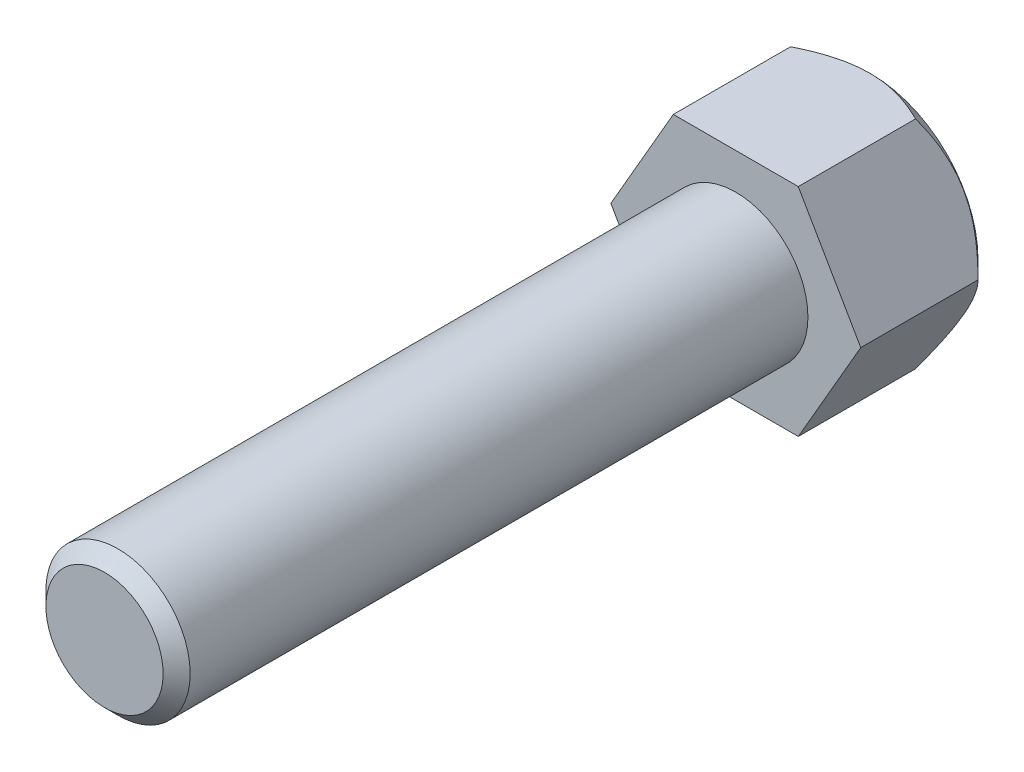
ISO-10303-21;
HEADER;
FILE_DESCRIPTION(('STEP AP214'),'2;1');
FILE_NAME('part.step','',(''),(''),'','','');
FILE_SCHEMA(('AUTOMOTIVE_DESIGN { 1 0 10303 214 1 1 1 1 }'));
ENDSEC;
DATA;
#1=APPLICATION_CONTEXT('core data for automotive mechanical design processes');
#2=APPLICATION_PROTOCOL_DEFINITION('international standard','automotive_design',2000,#1);
#3=PRODUCT_CONTEXT('',#1,'mechanical');
#4=PRODUCT('Part','Part','',(#3));
#5=PRODUCT_RELATED_PRODUCT_CATEGORY('part','',(#4));
#6=PRODUCT_DEFINITION_FORMATION('','',#4);
#7=PRODUCT_DEFINITION_CONTEXT('part definition',#1,'design');
#8=PRODUCT_DEFINITION('design','',#6,#7);
#9=PRODUCT_DEFINITION_SHAPE('','',#8);
#10=(LENGTH_UNIT() NAMED_UNIT(*) SI_UNIT(.MILLI.,.METRE.));
#11=(NAMED_UNIT(*) PLANE_ANGLE_UNIT() SI_UNIT($,.RADIAN.));
#12=(NAMED_UNIT(*) SI_UNIT($,.STERADIAN.) SOLID_ANGLE_UNIT());
#13=UNCERTAINTY_MEASURE_WITH_UNIT(LENGTH_MEASURE(1.E-05),#10,'distance_accuracy_value','');
#14=(GEOMETRIC_REPRESENTATION_CONTEXT(3) GLOBAL_UNCERTAINTY_ASSIGNED_CONTEXT((#13)) GLOBAL_UNIT_ASSIGNED_CONTEXT((#10,
#11,#12)) REPRESENTATION_CONTEXT('',''));
#15=CARTESIAN_POINT('',(0.,0.,0.));
#16=DIRECTION('',(0.,0.,1.));
#17=DIRECTION('',(1.,0.,0.));
#18=AXIS2_PLACEMENT_3D('',#15,#16,#17);
#19=CARTESIAN_POINT('',(6.92820323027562,-11.9999999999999,15.));
#20=DIRECTION('',(-0.866025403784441,0.499999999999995,0.));
#21=DIRECTION('',(-0.499999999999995,-0.866025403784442,0.));
#22=AXIS2_PLACEMENT_3D('',#19,#20,#21);
#23=PLANE('',#22);
#24=CARTESIAN_POINT('',(13.8565219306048,0.0002,2.0001154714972));
#25=CARTESIAN_POINT('',(13.7374109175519,-0.206106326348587,1.88102204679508));
#26=CARTESIAN_POINT('',(13.6173670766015,-0.414028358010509,1.76556272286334));
#27=CARTESIAN_POINT('',(13.3752685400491,-0.833355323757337,1.54306664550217));
#28=CARTESIAN_POINT('',(13.2532127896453,-1.04476208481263,1.43603449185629));
#29=CARTESIAN_POINT('',(13.006369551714,-1.47230711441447,1.23109384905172));
#30=CARTESIAN_POINT('',(12.8815704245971,-1.6884655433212,1.13324110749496));
#31=CARTESIAN_POINT('',(12.6299224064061,-2.12433269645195,0.948784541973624));
#32=CARTESIAN_POINT('',(12.5030738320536,-2.3440408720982,0.86217899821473));
#33=CARTESIAN_POINT('',(12.2493664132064,-2.78347501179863,0.702957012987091));
#34=CARTESIAN_POINT('',(12.1225387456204,-3.0031469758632,0.630143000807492));
#35=CARTESIAN_POINT('',(11.8671055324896,-3.4455702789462,0.498319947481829));
#36=CARTESIAN_POINT('',(11.7385001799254,-3.66832128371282,0.439309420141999));
#37=CARTESIAN_POINT('',(11.480061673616,-4.11594990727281,0.336578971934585));
#38=CARTESIAN_POINT('',(11.3502319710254,-4.34082154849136,0.292824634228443));
#39=CARTESIAN_POINT('',(11.0894826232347,-4.79245266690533,0.221567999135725));
#40=CARTESIAN_POINT('',(10.9585631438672,-5.01921185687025,0.194063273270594));
#41=CARTESIAN_POINT('',(10.6395223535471,-5.57180671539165,0.147945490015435));
#42=CARTESIAN_POINT('',(10.4510562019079,-5.89823966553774,0.138267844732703));
#43=CARTESIAN_POINT('',(10.0744647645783,-6.55051516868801,0.154512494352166));
#44=CARTESIAN_POINT('',(9.88633962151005,-6.87635747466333,0.180447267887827));
#45=CARTESIAN_POINT('',(9.5118627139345,-7.52497050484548,0.266385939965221));
#46=CARTESIAN_POINT('',(9.32551316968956,-7.84773738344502,0.326427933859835));
#47=CARTESIAN_POINT('',(8.95601707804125,-8.48772338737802,0.477317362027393));
#48=CARTESIAN_POINT('',(8.77287028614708,-8.80494293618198,0.568162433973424));
#49=CARTESIAN_POINT('',(8.44776278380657,-9.36804564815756,0.755051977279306));
#50=CARTESIAN_POINT('',(8.30508197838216,-9.6151760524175,0.846179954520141));
#51=CARTESIAN_POINT('',(8.02228146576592,-10.1050009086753,1.04311985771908));
#52=CARTESIAN_POINT('',(7.88216183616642,-10.3476952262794,1.14893222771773));
#53=CARTESIAN_POINT('',(7.60492501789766,-10.8278834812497,1.37286925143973));
#54=CARTESIAN_POINT('',(7.46779994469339,-11.065391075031,1.49095518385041));
#55=CARTESIAN_POINT('',(7.19608877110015,-11.5360086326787,1.73788924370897));
#56=CARTESIAN_POINT('',(7.06150117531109,-11.7691211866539,1.86673077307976));
#57=CARTESIAN_POINT('',(6.92808776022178,-12.0001999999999,2.0001154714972));
#58=B_SPLINE_CURVE_WITH_KNOTS('',3,(#24,#25,#26,#27,#28,#29,#30,#31,#32,#33,#34,#35,#36,#37,#38,
#39,#40,#41,#42,#43,#44,#45,#46,#47,#48,#49,#50,#51,#52,#53,#54,#55,#56,#57),.UNSPECIFIED.,.F.,
.F.,(4,2,2,2,2,2,2,2,2,2,2,2,2,2,2,2,4),(0.,0.79903119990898,1.59849555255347,2.40253734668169,
3.20645605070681,3.99780391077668,4.7890665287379,5.57853238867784,6.36788023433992,
7.49728680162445,8.62708921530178,9.75815602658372,10.8891361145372,11.7873913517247,
12.6856737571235,13.5812036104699,14.4761880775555),.UNSPECIFIED.);
#59=CARTESIAN_POINT('',(13.856406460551,0.,2.));
#60=VERTEX_POINT('',#59);
#61=CARTESIAN_POINT('',(6.92820323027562,-11.9999999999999,2.));
#62=VERTEX_POINT('',#61);
#63=EDGE_CURVE('E48',#60,#62,#58,.T.);
#64=ORIENTED_EDGE('',*,*,#63,.F.);
#65=DIRECTION('',(0.,0.,-1.));
#66=VECTOR('',#65,1.);
#67=CARTESIAN_POINT('',(13.856406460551,0.,15.));
#68=LINE('',#67,#66);
#69=CARTESIAN_POINT('',(13.856406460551,0.,15.));
#70=VERTEX_POINT('',#69);
#71=EDGE_CURVE('E119',#70,#60,#68,.T.);
#72=ORIENTED_EDGE('',*,*,#71,.F.);
#73=DIRECTION('',(0.499999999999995,0.866025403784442,0.));
#74=VECTOR('',#73,1.);
#75=CARTESIAN_POINT('',(6.92820323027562,-11.9999999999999,15.));
#76=LINE('',#75,#74);
#77=CARTESIAN_POINT('',(6.92820323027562,-11.9999999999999,15.));
#78=VERTEX_POINT('',#77);
#79=EDGE_CURVE('E212',#78,#70,#76,.T.);
#80=ORIENTED_EDGE('',*,*,#79,.F.);
#81=DIRECTION('',(0.,0.,-1.));
#82=VECTOR('',#81,1.);
#83=CARTESIAN_POINT('',(6.92820323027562,-11.9999999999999,15.));
#84=LINE('',#83,#82);
#85=EDGE_CURVE('E113',#78,#62,#84,.T.);
#86=ORIENTED_EDGE('',*,*,#85,.T.);
#87=EDGE_LOOP('',(#64,#72,#80,#86));
#88=FACE_BOUND('',#87,.T.);
#89=ADVANCED_FACE('F33',(#88),#23,.F.);
#90=CARTESIAN_POINT('',(13.856406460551,0.,15.));
#91=DIRECTION('',(-0.866025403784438,-0.500000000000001,0.));
#92=DIRECTION('',(0.500000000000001,-0.866025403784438,0.));
#93=AXIS2_PLACEMENT_3D('',#90,#91,#92);
#94=PLANE('',#93);
#95=CARTESIAN_POINT('',(6.92808776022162,12.0002,2.0001154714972));
#96=CARTESIAN_POINT('',(7.0471987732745,11.7938936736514,1.88102204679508));
#97=CARTESIAN_POINT('',(7.16724261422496,11.5859716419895,1.76556272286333));
#98=CARTESIAN_POINT('',(7.40934115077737,11.1666446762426,1.54306664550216));
#99=CARTESIAN_POINT('',(7.53139690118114,10.9552379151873,1.43603449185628));
#100=CARTESIAN_POINT('',(7.77824013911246,10.5276928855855,1.2310938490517));
#101=CARTESIAN_POINT('',(7.90303926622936,10.3115344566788,1.13324110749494));
#102=CARTESIAN_POINT('',(8.15468728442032,9.87566730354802,0.9487845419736));
#103=CARTESIAN_POINT('',(8.28153585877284,9.65595912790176,0.862178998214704));
#104=CARTESIAN_POINT('',(8.53524327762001,9.21652498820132,0.702957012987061));
#105=CARTESIAN_POINT('',(8.6620709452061,8.99685302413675,0.630143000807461));
#106=CARTESIAN_POINT('',(8.91750415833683,8.55442972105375,0.498319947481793));
#107=CARTESIAN_POINT('',(9.0461095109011,8.33167871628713,0.439309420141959));
#108=CARTESIAN_POINT('',(9.30454801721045,7.88405009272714,0.336578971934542));
#109=CARTESIAN_POINT('',(9.43437771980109,7.65917845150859,0.292824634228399));
#110=CARTESIAN_POINT('',(9.69512706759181,7.20754733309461,0.221567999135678));
#111=CARTESIAN_POINT('',(9.82604654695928,6.98078814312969,0.194063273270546));
#112=CARTESIAN_POINT('',(10.1450873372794,6.42819328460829,0.147945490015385));
#113=CARTESIAN_POINT('',(10.3335534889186,6.10176033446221,0.138267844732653));
#114=CARTESIAN_POINT('',(10.7101449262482,5.44948483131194,0.154512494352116));
#115=CARTESIAN_POINT('',(10.8982700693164,5.12364252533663,0.180447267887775));
#116=CARTESIAN_POINT('',(11.272746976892,4.47502949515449,0.266385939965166));
#117=CARTESIAN_POINT('',(11.4590965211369,4.15226261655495,0.32642793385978));
#118=CARTESIAN_POINT('',(11.8285926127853,3.51227661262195,0.477317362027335));
#119=CARTESIAN_POINT('',(12.0117394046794,3.19505706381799,0.568162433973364));
#120=CARTESIAN_POINT('',(12.3368469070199,2.63195435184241,0.755051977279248));
#121=CARTESIAN_POINT('',(12.4795277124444,2.38482394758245,0.846179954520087));
#122=CARTESIAN_POINT('',(12.7623282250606,1.89499909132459,1.04311985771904));
#123=CARTESIAN_POINT('',(12.9024478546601,1.65230477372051,1.14893222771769));
#124=CARTESIAN_POINT('',(13.1796846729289,1.17211651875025,1.3728692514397));
#125=CARTESIAN_POINT('',(13.3168097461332,0.934608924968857,1.49095518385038));
#126=CARTESIAN_POINT('',(13.5885209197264,0.463991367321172,1.73788924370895));
#127=CARTESIAN_POINT('',(13.7231085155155,0.230878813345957,1.86673077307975));
#128=CARTESIAN_POINT('',(13.8565219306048,-0.000199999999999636,2.0001154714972));
#129=B_SPLINE_CURVE_WITH_KNOTS('',3,(#95,#96,#97,#98,#99,#100,#101,#102,#103,#104,#105,#106,
#107,#108,#109,#110,#111,#112,#113,#114,#115,#116,#117,#118,#119,#120,#121,#122,#123,#124,#125,
#126,#127,#128),.UNSPECIFIED.,.F.,.F.,(4,2,2,2,2,2,2,2,2,2,2,2,2,2,2,2,4),(0.,0.799031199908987,
1.59849555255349,2.40253734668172,3.20645605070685,3.99780391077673,4.78906652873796,
5.5785323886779,6.36788023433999,7.49728680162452,8.62708921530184,9.75815602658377,
10.8891361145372,11.7873913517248,12.6856737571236,13.58120361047,14.4761880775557),.UNSPECIFIED.);
#130=CARTESIAN_POINT('',(6.92820323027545,12.,2.));
#131=VERTEX_POINT('',#130);
#132=EDGE_CURVE('E157',#131,#60,#129,.T.);
#133=ORIENTED_EDGE('',*,*,#132,.F.);
#134=DIRECTION('',(0.,0.,-1.));
#135=VECTOR('',#134,1.);
#136=CARTESIAN_POINT('',(6.92820323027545,12.,15.));
#137=LINE('',#136,#135);
#138=CARTESIAN_POINT('',(6.92820323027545,12.,15.));
#139=VERTEX_POINT('',#138);
#140=EDGE_CURVE('E111',#139,#131,#137,.T.);
#141=ORIENTED_EDGE('',*,*,#140,.F.);
#142=DIRECTION('',(-0.500000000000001,0.866025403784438,0.));
#143=VECTOR('',#142,1.);
#144=CARTESIAN_POINT('',(13.856406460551,0.,15.));
#145=LINE('',#144,#143);
#146=EDGE_CURVE('E213',#70,#139,#145,.T.);
#147=ORIENTED_EDGE('',*,*,#146,.F.);
#148=ORIENTED_EDGE('',*,*,#71,.T.);
#149=EDGE_LOOP('',(#133,#141,#147,#148));
#150=FACE_BOUND('',#149,.T.);
#151=ADVANCED_FACE('F139',(#150),#94,.F.);
#152=CARTESIAN_POINT('',(6.92820323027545,12.,15.));
#153=DIRECTION('',(0.,-1.,0.));
#154=DIRECTION('',(1.,0.,0.));
#155=AXIS2_PLACEMENT_3D('',#152,#153,#154);
#156=PLANE('',#155);
#157=CARTESIAN_POINT('',(-14.4006888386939,11.9999999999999,6.88872194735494));
#158=CARTESIAN_POINT('',(-14.0525506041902,11.9999999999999,6.62132963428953));
#159=CARTESIAN_POINT('',(-13.702529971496,11.9999999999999,6.35634952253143));
#160=CARTESIAN_POINT('',(-12.9979568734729,11.9999999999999,5.83231381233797));
#161=CARTESIAN_POINT('',(-12.6434033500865,11.9999999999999,5.57325963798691));
#162=CARTESIAN_POINT('',(-11.9264058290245,11.9999999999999,5.06033222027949));
#163=CARTESIAN_POINT('',(-11.563922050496,11.9999999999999,4.80651440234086));
#164=CARTESIAN_POINT('',(-10.8329104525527,11.9999999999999,4.30776676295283));
#165=CARTESIAN_POINT('',(-10.4643830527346,11.9999999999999,4.06283632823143));
#166=CARTESIAN_POINT('',(-9.69689227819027,11.9999999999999,3.56883504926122));
#167=CARTESIAN_POINT('',(-9.29747155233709,11.9999999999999,3.32047118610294));
#168=CARTESIAN_POINT('',(-8.48925422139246,11.9999999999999,2.83923861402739));
#169=CARTESIAN_POINT('',(-8.08045606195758,11.9999999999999,2.60637249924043));
#170=CARTESIAN_POINT('',(-7.25338535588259,11.9999999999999,2.1611005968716));
#171=CARTESIAN_POINT('',(-6.83514540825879,11.9999999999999,1.94863473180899));
#172=CARTESIAN_POINT('',(-5.98687825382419,11.9999999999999,1.54892336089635));
#173=CARTESIAN_POINT('',(-5.55685670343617,11.9999999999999,1.36166599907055));
#174=CARTESIAN_POINT('',(-4.72649804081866,11.9999999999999,1.03578420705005));
#175=CARTESIAN_POINT('',(-4.32733328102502,11.9999999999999,0.894202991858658));
#176=CARTESIAN_POINT('',(-3.51888368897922,11.9999999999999,0.642996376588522));
#177=CARTESIAN_POINT('',(-3.10959820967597,11.9999999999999,0.533373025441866));
#178=CARTESIAN_POINT('',(-2.29045033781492,11.9999999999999,0.353823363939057));
#179=CARTESIAN_POINT('',(-1.88074784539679,11.9999999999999,0.283179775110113));
#180=CARTESIAN_POINT('',(-1.05631578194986,11.9999999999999,0.183054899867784));
#181=CARTESIAN_POINT('',(-0.641587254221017,11.9999999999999,0.153565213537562));
#182=CARTESIAN_POINT('',(0.170838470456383,11.9999999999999,0.138231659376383));
#183=CARTESIAN_POINT('',(0.568501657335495,11.9999999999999,0.15056659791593));
#184=CARTESIAN_POINT('',(1.36069882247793,12.,0.214033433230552));
#185=CARTESIAN_POINT('',(1.75523251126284,12.,0.265168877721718));
#186=CARTESIAN_POINT('',(2.5449997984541,12.,0.404223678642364));
#187=CARTESIAN_POINT('',(2.94011749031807,12.,0.492790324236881));
#188=CARTESIAN_POINT('',(3.72166087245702,12.,0.701811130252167));
#189=CARTESIAN_POINT('',(4.10808707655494,12.,0.822263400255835));
#190=CARTESIAN_POINT('',(4.89467698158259,12.,1.09789614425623));
#191=CARTESIAN_POINT('',(5.29425095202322,12.,1.25474070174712));
#192=CARTESIAN_POINT('',(6.08311372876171,12.,1.59265019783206));
#193=CARTESIAN_POINT('',(6.47239778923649,12.,1.7737260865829));
#194=CARTESIAN_POINT('',(7.24252407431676,12.,2.15580316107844));
#195=CARTESIAN_POINT('',(7.62333555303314,12.,2.35686581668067));
#196=CARTESIAN_POINT('',(8.37622961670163,12.,2.77449026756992));
#197=CARTESIAN_POINT('',(8.74831353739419,12.,2.99104967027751));
#198=CARTESIAN_POINT('',(9.46670058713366,12.,3.42563335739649));
#199=CARTESIAN_POINT('',(9.81336920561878,12.,3.64305666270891));
#200=CARTESIAN_POINT('',(10.5007506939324,12.,4.0871497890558));
#201=CARTESIAN_POINT('',(10.8414631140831,12.,4.31382030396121));
#202=CARTESIAN_POINT('',(11.5149702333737,12.,4.77291112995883));
#203=CARTESIAN_POINT('',(11.8478065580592,12.,5.00527059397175));
#204=CARTESIAN_POINT('',(12.5089143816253,12.,5.47621212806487));
#205=CARTESIAN_POINT('',(12.8371871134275,12.,5.71479246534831));
#206=CARTESIAN_POINT('',(13.1635457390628,12.,5.95591894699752));
#207=B_SPLINE_CURVE_WITH_KNOTS('',3,(#157,#158,#159,#160,#161,#162,#163,#164,#165,#166,#167,
#168,#169,#170,#171,#172,#173,#174,#175,#176,#177,#178,#179,#180,#181,#182,#183,#184,#185,#186,
#187,#188,#189,#190,#191,#192,#193,#194,#195,#196,#197,#198,#199,#200,#201,#202,#203,#204,#205,
#206),.UNSPECIFIED.,.F.,.F.,(4,2,2,2,2,2,2,2,2,2,2,2,2,2,2,2,2,2,2,2,2,2,2,2,4),(0.,
1.31694874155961,2.63421070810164,3.96164041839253,5.28897835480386,6.69972456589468,
8.11070632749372,9.51739647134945,10.9234226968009,12.19291615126,13.4624909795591,
14.7078506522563,15.9529560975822,17.1445538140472,18.3362604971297,19.5494774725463,
20.7626225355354,22.0493986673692,23.336758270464,24.6282074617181,25.9194576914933,
27.1469127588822,28.3744600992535,29.5921423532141,30.809488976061),.UNSPECIFIED.);
#208=CARTESIAN_POINT('',(-6.92820323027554,11.9999999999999,2.));
#209=VERTEX_POINT('',#208);
#210=EDGE_CURVE('E105',#209,#131,#207,.T.);
#211=ORIENTED_EDGE('',*,*,#210,.F.);
#212=DIRECTION('',(0.,0.,-1.));
#213=VECTOR('',#212,1.);
#214=CARTESIAN_POINT('',(-6.92820323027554,11.9999999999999,15.));
#215=LINE('',#214,#213);
#216=CARTESIAN_POINT('',(-6.92820323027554,11.9999999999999,15.));
#217=VERTEX_POINT('',#216);
#218=EDGE_CURVE('E104',#217,#209,#215,.T.);
#219=ORIENTED_EDGE('',*,*,#218,.F.);
#220=DIRECTION('',(-1.,0.,0.));
#221=VECTOR('',#220,1.);
#222=CARTESIAN_POINT('',(6.92820323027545,12.,15.));
#223=LINE('',#222,#221);
#224=EDGE_CURVE('E216',#139,#217,#223,.T.);
#225=ORIENTED_EDGE('',*,*,#224,.F.);
#226=ORIENTED_EDGE('',*,*,#140,.T.);
#227=EDGE_LOOP('',(#211,#219,#225,#226));
#228=FACE_BOUND('',#227,.T.);
#229=ADVANCED_FACE('F144',(#228),#156,.F.);
#230=CARTESIAN_POINT('',(-6.92820323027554,11.9999999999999,15.));
#231=DIRECTION('',(0.866025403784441,-0.499999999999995,0.));
#232=DIRECTION('',(0.499999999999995,0.866025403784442,0.));
#233=AXIS2_PLACEMENT_3D('',#230,#231,#232);
#234=PLANE('',#233);
#235=CARTESIAN_POINT('',(-13.8565219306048,-0.000200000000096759,2.0001154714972));
#236=CARTESIAN_POINT('',(-13.7374109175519,0.206106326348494,1.88102204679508));
#237=CARTESIAN_POINT('',(-13.6173670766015,0.414028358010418,1.76556272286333));
#238=CARTESIAN_POINT('',(-13.3752685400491,0.83335532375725,1.54306664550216));
#239=CARTESIAN_POINT('',(-13.2532127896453,1.04476208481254,1.43603449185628));
#240=CARTESIAN_POINT('',(-13.006369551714,1.47230711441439,1.2310938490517));
#241=CARTESIAN_POINT('',(-12.8815704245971,1.68846554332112,1.13324110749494));
#242=CARTESIAN_POINT('',(-12.6299224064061,2.12433269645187,0.9487845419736));
#243=CARTESIAN_POINT('',(-12.5030738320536,2.34404087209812,0.862178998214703));
#244=CARTESIAN_POINT('',(-12.2493664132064,2.78347501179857,0.702957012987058));
#245=CARTESIAN_POINT('',(-12.1225387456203,3.00314697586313,0.630143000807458));
#246=CARTESIAN_POINT('',(-11.8671055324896,3.44557027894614,0.49831994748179));
#247=CARTESIAN_POINT('',(-11.7385001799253,3.66832128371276,0.439309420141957));
#248=CARTESIAN_POINT('',(-11.480061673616,4.11594990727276,0.33657897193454));
#249=CARTESIAN_POINT('',(-11.3502319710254,4.34082154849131,0.292824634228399));
#250=CARTESIAN_POINT('',(-11.0894826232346,4.79245266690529,0.221567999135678));
#251=CARTESIAN_POINT('',(-10.9585631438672,5.01921185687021,0.194063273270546));
#252=CARTESIAN_POINT('',(-10.639522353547,5.57180671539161,0.147945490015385));
#253=CARTESIAN_POINT('',(-10.4510562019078,5.8982396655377,0.138267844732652));
#254=CARTESIAN_POINT('',(-10.0744647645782,6.55051516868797,0.154512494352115));
#255=CARTESIAN_POINT('',(-9.88633962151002,6.87635747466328,0.180447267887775));
#256=CARTESIAN_POINT('',(-9.51186271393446,7.52497050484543,0.266385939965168));
#257=CARTESIAN_POINT('',(-9.32551316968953,7.84773738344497,0.326427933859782));
#258=CARTESIAN_POINT('',(-8.95601707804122,8.48772338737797,0.477317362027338));
#259=CARTESIAN_POINT('',(-8.77287028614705,8.80494293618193,0.568162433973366));
#260=CARTESIAN_POINT('',(-8.44776278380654,9.36804564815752,0.755051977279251));
#261=CARTESIAN_POINT('',(-8.30508197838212,9.61517605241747,0.846179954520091));
#262=CARTESIAN_POINT('',(-8.02228146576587,10.1050009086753,1.04311985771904));
#263=CARTESIAN_POINT('',(-7.88216183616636,10.3476952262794,1.14893222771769));
#264=CARTESIAN_POINT('',(-7.6049250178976,10.8278834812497,1.3728692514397));
#265=CARTESIAN_POINT('',(-7.46779994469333,11.0653910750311,1.49095518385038));
#266=CARTESIAN_POINT('',(-7.19608877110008,11.5360086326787,1.73788924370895));
#267=CARTESIAN_POINT('',(-7.06150117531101,11.769121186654,1.86673077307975));
#268=CARTESIAN_POINT('',(-6.9280877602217,12.0001999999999,2.0001154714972));
#269=B_SPLINE_CURVE_WITH_KNOTS('',3,(#235,#236,#237,#238,#239,#240,#241,#242,#243,#244,#245,
#246,#247,#248,#249,#250,#251,#252,#253,#254,#255,#256,#257,#258,#259,#260,#261,#262,#263,#264,
#265,#266,#267,#268),.UNSPECIFIED.,.F.,.F.,(4,2,2,2,2,2,2,2,2,2,2,2,2,2,2,2,4),(0.,
0.799031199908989,1.59849555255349,2.40253734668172,3.20645605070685,3.99780391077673,
4.78906652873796,5.57853238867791,6.36788023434,7.49728680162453,8.62708921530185,
9.75815602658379,10.8891361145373,11.7873913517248,12.6856737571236,13.58120361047,
14.4761880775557),.UNSPECIFIED.);
#270=CARTESIAN_POINT('',(-13.856406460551,0.,2.));
#271=VERTEX_POINT('',#270);
#272=EDGE_CURVE('E88',#271,#209,#269,.T.);
#273=ORIENTED_EDGE('',*,*,#272,.F.);
#274=DIRECTION('',(0.,0.,-1.));
#275=VECTOR('',#274,1.);
#276=CARTESIAN_POINT('',(-13.856406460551,0.,15.));
#277=LINE('',#276,#275);
#278=CARTESIAN_POINT('',(-13.856406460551,0.,15.));
#279=VERTEX_POINT('',#278);
#280=EDGE_CURVE('E101',#279,#271,#277,.T.);
#281=ORIENTED_EDGE('',*,*,#280,.F.);
#282=DIRECTION('',(-0.499999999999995,-0.866025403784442,0.));
#283=VECTOR('',#282,1.);
#284=CARTESIAN_POINT('',(-6.92820323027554,11.9999999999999,15.));
#285=LINE('',#284,#283);
#286=EDGE_CURVE('E220',#217,#279,#285,.T.);
#287=ORIENTED_EDGE('',*,*,#286,.F.);
#288=ORIENTED_EDGE('',*,*,#218,.T.);
#289=EDGE_LOOP('',(#273,#281,#287,#288));
#290=FACE_BOUND('',#289,.T.);
#291=ADVANCED_FACE('F99',(#290),#234,.F.);
#292=CARTESIAN_POINT('',(-13.856406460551,0.,15.));
#293=DIRECTION('',(0.866025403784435,0.500000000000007,0.));
#294=DIRECTION('',(-0.500000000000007,0.866025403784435,0.));
#295=AXIS2_PLACEMENT_3D('',#292,#293,#294);
#296=PLANE('',#295);
#297=CARTESIAN_POINT('',(-6.92808776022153,-12.0002,2.0001154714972));
#298=CARTESIAN_POINT('',(-7.04719877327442,-11.7938936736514,1.88102204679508));
#299=CARTESIAN_POINT('',(-7.16724261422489,-11.5859716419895,1.76556272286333));
#300=CARTESIAN_POINT('',(-7.40934115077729,-11.1666446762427,1.54306664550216));
#301=CARTESIAN_POINT('',(-7.53139690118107,-10.9552379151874,1.43603449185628));
#302=CARTESIAN_POINT('',(-7.77824013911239,-10.5276928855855,1.2310938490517));
#303=CARTESIAN_POINT('',(-7.90303926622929,-10.3115344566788,1.13324110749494));
#304=CARTESIAN_POINT('',(-8.15468728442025,-9.87566730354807,0.948784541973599));
#305=CARTESIAN_POINT('',(-8.28153585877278,-9.65595912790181,0.862178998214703));
#306=CARTESIAN_POINT('',(-8.53524327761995,-9.21652498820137,0.702957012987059));
#307=CARTESIAN_POINT('',(-8.66207094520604,-8.99685302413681,0.630143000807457));
#308=CARTESIAN_POINT('',(-8.91750415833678,-8.55442972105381,0.498319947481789));
#309=CARTESIAN_POINT('',(-9.04610951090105,-8.33167871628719,0.439309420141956));
#310=CARTESIAN_POINT('',(-9.3045480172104,-7.88405009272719,0.33657897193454));
#311=CARTESIAN_POINT('',(-9.43437771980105,-7.65917845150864,0.292824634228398));
#312=CARTESIAN_POINT('',(-9.69512706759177,-7.20754733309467,0.221567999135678));
#313=CARTESIAN_POINT('',(-9.82604654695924,-6.98078814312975,0.194063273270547));
#314=CARTESIAN_POINT('',(-10.1450873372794,-6.42819328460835,0.147945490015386));
#315=CARTESIAN_POINT('',(-10.3335534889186,-6.10176033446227,0.138267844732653));
#316=CARTESIAN_POINT('',(-10.7101449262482,-5.449484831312,0.154512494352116));
#317=CARTESIAN_POINT('',(-10.8982700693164,-5.12364252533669,0.180447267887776));
#318=CARTESIAN_POINT('',(-11.272746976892,-4.47502949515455,0.266385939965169));
#319=CARTESIAN_POINT('',(-11.4590965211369,-4.15226261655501,0.326427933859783));
#320=CARTESIAN_POINT('',(-11.8285926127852,-3.51227661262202,0.47731736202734));
#321=CARTESIAN_POINT('',(-12.0117394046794,-3.19505706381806,0.56816243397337));
#322=CARTESIAN_POINT('',(-12.3368469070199,-2.63195435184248,0.755051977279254));
#323=CARTESIAN_POINT('',(-12.4795277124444,-2.38482394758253,0.846179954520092));
#324=CARTESIAN_POINT('',(-12.7623282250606,-1.89499909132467,1.04311985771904));
#325=CARTESIAN_POINT('',(-12.9024478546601,-1.65230477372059,1.14893222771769));
#326=CARTESIAN_POINT('',(-13.1796846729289,-1.17211651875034,1.3728692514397));
#327=CARTESIAN_POINT('',(-13.3168097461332,-0.934608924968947,1.49095518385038));
#328=CARTESIAN_POINT('',(-13.5885209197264,-0.463991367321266,1.73788924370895));
#329=CARTESIAN_POINT('',(-13.7231085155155,-0.230878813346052,1.86673077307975));
#330=CARTESIAN_POINT('',(-13.8565219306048,0.000199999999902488,2.0001154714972));
#331=B_SPLINE_CURVE_WITH_KNOTS('',3,(#297,#298,#299,#300,#301,#302,#303,#304,#305,#306,#307,
#308,#309,#310,#311,#312,#313,#314,#315,#316,#317,#318,#319,#320,#321,#322,#323,#324,#325,#326,
#327,#328,#329,#330),.UNSPECIFIED.,.F.,.F.,(4,2,2,2,2,2,2,2,2,2,2,2,2,2,2,2,4),(0.,
0.799031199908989,1.59849555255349,2.40253734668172,3.20645605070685,3.99780391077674,
4.78906652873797,5.57853238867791,6.36788023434,7.49728680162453,8.62708921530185,
9.75815602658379,10.8891361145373,11.7873913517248,12.6856737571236,13.58120361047,
14.4761880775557),.UNSPECIFIED.);
#332=CARTESIAN_POINT('',(-6.92820323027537,-12.,2.));
#333=VERTEX_POINT('',#332);
#334=EDGE_CURVE('E85',#333,#271,#331,.T.);
#335=ORIENTED_EDGE('',*,*,#334,.F.);
#336=DIRECTION('',(0.,0.,-1.));
#337=VECTOR('',#336,1.);
#338=CARTESIAN_POINT('',(-6.92820323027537,-12.,15.));
#339=LINE('',#338,#337);
#340=CARTESIAN_POINT('',(-6.92820323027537,-12.,15.));
#341=VERTEX_POINT('',#340);
#342=EDGE_CURVE('E109',#341,#333,#339,.T.);
#343=ORIENTED_EDGE('',*,*,#342,.F.);
#344=DIRECTION('',(0.500000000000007,-0.866025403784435,0.));
#345=VECTOR('',#344,1.);
#346=CARTESIAN_POINT('',(-13.856406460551,0.,15.));
#347=LINE('',#346,#345);
#348=EDGE_CURVE('E108',#279,#341,#347,.T.);
#349=ORIENTED_EDGE('',*,*,#348,.F.);
#350=ORIENTED_EDGE('',*,*,#280,.T.);
#351=EDGE_LOOP('',(#335,#343,#349,#350));
#352=FACE_BOUND('',#351,.T.);
#353=ADVANCED_FACE('F107',(#352),#296,.F.);
#354=CARTESIAN_POINT('',(-6.92820323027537,-12.,15.));
#355=DIRECTION('',(0.,1.,0.));
#356=DIRECTION('',(-1.,0.,0.));
#357=AXIS2_PLACEMENT_3D('',#354,#355,#356);
#358=PLANE('',#357);
#359=CARTESIAN_POINT('',(-14.400688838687,-12.0000000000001,6.88872194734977));
#360=CARTESIAN_POINT('',(-14.0525506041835,-12.0000000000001,6.62132963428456));
#361=CARTESIAN_POINT('',(-13.7025299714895,-12.0000000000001,6.35634952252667));
#362=CARTESIAN_POINT('',(-12.9979568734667,-12.0000000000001,5.8323138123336));
#363=CARTESIAN_POINT('',(-12.6434033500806,-12.0000000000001,5.57325963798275));
#364=CARTESIAN_POINT('',(-11.926405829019,-12.0000000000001,5.06033222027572));
#365=CARTESIAN_POINT('',(-11.5639220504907,-12.0000000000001,4.80651440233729));
#366=CARTESIAN_POINT('',(-10.8329104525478,-12.0000000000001,4.30776676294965));
#367=CARTESIAN_POINT('',(-10.4643830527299,-12.0000000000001,4.06283632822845));
#368=CARTESIAN_POINT('',(-9.69689227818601,-12.,3.56883504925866));
#369=CARTESIAN_POINT('',(-9.29747155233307,-12.,3.32047118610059));
#370=CARTESIAN_POINT('',(-8.48925422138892,-12.,2.83923861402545));
#371=CARTESIAN_POINT('',(-8.0804560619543,-12.,2.6063724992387));
#372=CARTESIAN_POINT('',(-7.25338535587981,-12.,2.16110059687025));
#373=CARTESIAN_POINT('',(-6.83514540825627,-12.,1.94863473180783));
#374=CARTESIAN_POINT('',(-5.98687825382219,-12.,1.54892336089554));
#375=CARTESIAN_POINT('',(-5.55685670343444,-12.,1.36166599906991));
#376=CARTESIAN_POINT('',(-4.72649804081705,-12.,1.03578420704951));
#377=CARTESIAN_POINT('',(-4.32733328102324,-12.,0.894202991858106));
#378=CARTESIAN_POINT('',(-3.51888368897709,-12.,0.642996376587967));
#379=CARTESIAN_POINT('',(-3.10959820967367,-12.,0.533373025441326));
#380=CARTESIAN_POINT('',(-2.29045033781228,-12.,0.353823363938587));
#381=CARTESIAN_POINT('',(-1.88074784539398,-12.,0.283179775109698));
#382=CARTESIAN_POINT('',(-1.05631578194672,-12.,0.183054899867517));
#383=CARTESIAN_POINT('',(-0.641587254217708,-12.,0.153565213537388));
#384=CARTESIAN_POINT('',(0.170838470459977,-11.9999999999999,0.138231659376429));
#385=CARTESIAN_POINT('',(0.568501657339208,-11.9999999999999,0.150566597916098));
#386=CARTESIAN_POINT('',(1.36069882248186,-11.9999999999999,0.214033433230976));
#387=CARTESIAN_POINT('',(1.75523251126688,-11.9999999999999,0.265168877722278));
#388=CARTESIAN_POINT('',(2.54499979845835,-11.9999999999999,0.404223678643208));
#389=CARTESIAN_POINT('',(2.94011749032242,-11.9999999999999,0.492790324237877));
#390=CARTESIAN_POINT('',(3.72166087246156,-11.9999999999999,0.701811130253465));
#391=CARTESIAN_POINT('',(4.10808707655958,-11.9999999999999,0.822263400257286));
#392=CARTESIAN_POINT('',(4.89467698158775,-11.9999999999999,1.09789614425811));
#393=CARTESIAN_POINT('',(5.29425095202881,-11.9999999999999,1.2547407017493));
#394=CARTESIAN_POINT('',(6.08311372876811,-11.9999999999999,1.59265019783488));
#395=CARTESIAN_POINT('',(6.4723977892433,-11.9999999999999,1.77372608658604));
#396=CARTESIAN_POINT('',(7.24252407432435,-11.9999999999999,2.15580316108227));
#397=CARTESIAN_POINT('',(7.62333555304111,-11.9999999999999,2.35686581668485));
#398=CARTESIAN_POINT('',(8.37622961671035,-11.9999999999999,2.77449026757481));
#399=CARTESIAN_POINT('',(8.74831353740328,-11.9999999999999,2.99104967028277));
#400=CARTESIAN_POINT('',(9.46670058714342,-11.9999999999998,3.42563335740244));
#401=CARTESIAN_POINT('',(9.81336920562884,-11.9999999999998,3.64305666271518));
#402=CARTESIAN_POINT('',(10.5007506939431,-11.9999999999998,4.08714978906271));
#403=CARTESIAN_POINT('',(10.841463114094,-11.9999999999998,4.31382030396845));
#404=CARTESIAN_POINT('',(11.5149702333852,-11.9999999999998,4.77291112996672));
#405=CARTESIAN_POINT('',(11.847806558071,-11.9999999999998,5.00527059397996));
#406=CARTESIAN_POINT('',(12.5089143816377,-11.9999999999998,5.47621212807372));
#407=CARTESIAN_POINT('',(12.8371871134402,-11.9999999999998,5.71479246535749));
#408=CARTESIAN_POINT('',(13.1635457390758,-11.9999999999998,5.95591894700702));
#409=B_SPLINE_CURVE_WITH_KNOTS('',3,(#359,#360,#361,#362,#363,#364,#365,#366,#367,#368,#369,
#370,#371,#372,#373,#374,#375,#376,#377,#378,#379,#380,#381,#382,#383,#384,#385,#386,#387,#388,
#389,#390,#391,#392,#393,#394,#395,#396,#397,#398,#399,#400,#401,#402,#403,#404,#405,#406,#407,
#408),.UNSPECIFIED.,.F.,.F.,(4,2,2,2,2,2,2,2,2,2,2,2,2,2,2,2,2,2,2,2,2,2,2,2,4),(0.,
1.31694874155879,2.63421070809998,3.96164041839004,5.28897835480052,6.6997245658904,
8.11070632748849,9.51739647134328,10.9234226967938,12.1929161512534,13.462490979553,
14.7078506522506,15.952956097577,17.1445538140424,18.3362604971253,19.5494774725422,
20.7626225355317,22.0493986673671,23.3367582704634,24.628207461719,25.9194576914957,
27.1469127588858,28.3744600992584,29.5921423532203,30.8094889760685),.UNSPECIFIED.);
#410=EDGE_CURVE('E90',#62,#333,#409,.F.);
#411=ORIENTED_EDGE('',*,*,#410,.F.);
#412=ORIENTED_EDGE('',*,*,#85,.F.);
#413=DIRECTION('',(1.,0.,0.));
#414=VECTOR('',#413,1.);
#415=CARTESIAN_POINT('',(-6.92820323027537,-12.,15.));
#416=LINE('',#415,#414);
#417=EDGE_CURVE('E56',#341,#78,#416,.T.);
#418=ORIENTED_EDGE('',*,*,#417,.F.);
#419=ORIENTED_EDGE('',*,*,#342,.T.);
#420=EDGE_LOOP('',(#411,#412,#418,#419));
#421=FACE_BOUND('',#420,.T.);
#422=ADVANCED_FACE('F194',(#421),#358,.F.);
#423=CARTESIAN_POINT('',(0.,0.,15.));
#424=DIRECTION('',(0.,0.,1.));
#425=DIRECTION('',(1.,0.,0.));
#426=AXIS2_PLACEMENT_3D('',#423,#424,#425);
#427=PLANE('',#426);
#428=CARTESIAN_POINT('',(0.,0.,15.));
#429=DIRECTION('',(0.,0.,1.));
#430=DIRECTION('',(1.,0.,0.));
#431=AXIS2_PLACEMENT_3D('',#428,#429,#430);
#432=CIRCLE('',#431,8.);
#433=CARTESIAN_POINT('',(8.,0.,15.));
#434=VERTEX_POINT('',#433);
#435=EDGE_CURVE('E156',#434,#434,#432,.T.);
#436=ORIENTED_EDGE('',*,*,#435,.F.);
#437=EDGE_LOOP('',(#436));
#438=FACE_BOUND('',#437,.T.);
#439=ORIENTED_EDGE('',*,*,#79,.T.);
#440=ORIENTED_EDGE('',*,*,#146,.T.);
#441=ORIENTED_EDGE('',*,*,#224,.T.);
#442=ORIENTED_EDGE('',*,*,#286,.T.);
#443=ORIENTED_EDGE('',*,*,#348,.T.);
#444=ORIENTED_EDGE('',*,*,#417,.T.);
#445=EDGE_LOOP('',(#439,#440,#441,#442,#443,#444));
#446=FACE_BOUND('',#445,.T.);
#447=ADVANCED_FACE('F198',(#438,#446),#427,.T.);
#448=CARTESIAN_POINT('',(0.,0.,85.));
#449=DIRECTION('',(0.,0.,-1.));
#450=DIRECTION('',(-1.,0.,0.));
#451=AXIS2_PLACEMENT_3D('',#448,#449,#450);
#452=CYLINDRICAL_SURFACE('',#451,8.);
#453=CARTESIAN_POINT('',(0.,0.,83.5));
#454=DIRECTION('',(0.,0.,1.));
#455=DIRECTION('',(1.,0.,0.));
#456=AXIS2_PLACEMENT_3D('',#453,#454,#455);
#457=CIRCLE('',#456,8.);
#458=CARTESIAN_POINT('',(8.,0.,83.5));
#459=VERTEX_POINT('',#458);
#460=EDGE_CURVE('E11',#459,#459,#457,.F.);
#461=ORIENTED_EDGE('',*,*,#460,.T.);
#462=EDGE_LOOP('',(#461));
#463=FACE_BOUND('',#462,.T.);
#464=ORIENTED_EDGE('',*,*,#435,.T.);
#465=EDGE_LOOP('',(#464));
#466=FACE_BOUND('',#465,.T.);
#467=ADVANCED_FACE('F135',(#463,#466),#452,.T.);
#468=CARTESIAN_POINT('',(0.,0.,85.));
#469=DIRECTION('',(0.,0.,1.));
#470=DIRECTION('',(1.,0.,0.));
#471=AXIS2_PLACEMENT_3D('',#468,#469,#470);
#472=PLANE('',#471);
#473=CARTESIAN_POINT('',(0.,0.,85.));
#474=DIRECTION('',(0.,0.,1.));
#475=DIRECTION('',(1.,0.,0.));
#476=AXIS2_PLACEMENT_3D('',#473,#474,#475);
#477=CIRCLE('',#476,6.50000000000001);
#478=CARTESIAN_POINT('',(6.50000000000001,0.,85.));
#479=VERTEX_POINT('',#478);
#480=EDGE_CURVE('E41',#479,#479,#477,.T.);
#481=ORIENTED_EDGE('',*,*,#480,.T.);
#482=EDGE_LOOP('',(#481));
#483=FACE_BOUND('',#482,.T.);
#484=ADVANCED_FACE('F124',(#483),#472,.T.);
#485=CARTESIAN_POINT('',(0.,0.,85.));
#486=DIRECTION('',(0.,0.,-1.));
#487=DIRECTION('',(-1.,0.,0.));
#488=AXIS2_PLACEMENT_3D('',#485,#486,#487);
#489=CONICAL_SURFACE('',#488,6.50000000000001,0.785398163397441);
#490=ORIENTED_EDGE('',*,*,#460,.F.);
#491=EDGE_LOOP('',(#490));
#492=FACE_BOUND('',#491,.T.);
#493=ORIENTED_EDGE('',*,*,#480,.F.);
#494=EDGE_LOOP('',(#493));
#495=FACE_BOUND('',#494,.T.);
#496=ADVANCED_FACE('F35',(#492,#495),#489,.T.);
#497=CARTESIAN_POINT('',(0.,0.,0.));
#498=DIRECTION('',(0.,0.,1.));
#499=DIRECTION('',(1.,0.,0.));
#500=AXIS2_PLACEMENT_3D('',#497,#498,#499);
#501=CONICAL_SURFACE('',#500,11.856406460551,0.785398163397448);
#502=CARTESIAN_POINT('',(0.,0.,0.));
#503=DIRECTION('',(0.,0.,-1.));
#504=DIRECTION('',(-1.,0.,0.));
#505=AXIS2_PLACEMENT_3D('',#502,#503,#504);
#506=CIRCLE('',#505,11.856406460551);
#507=CARTESIAN_POINT('',(-11.856406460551,0.,0.));
#508=VERTEX_POINT('',#507);
#509=EDGE_CURVE('E224',#508,#508,#506,.T.);
#510=ORIENTED_EDGE('',*,*,#509,.F.);
#511=EDGE_LOOP('',(#510));
#512=FACE_BOUND('',#511,.T.);
#513=ORIENTED_EDGE('',*,*,#63,.T.);
#514=ORIENTED_EDGE('',*,*,#410,.T.);
#515=ORIENTED_EDGE('',*,*,#334,.T.);
#516=ORIENTED_EDGE('',*,*,#272,.T.);
#517=ORIENTED_EDGE('',*,*,#210,.T.);
#518=ORIENTED_EDGE('',*,*,#132,.T.);
#519=EDGE_LOOP('',(#513,#514,#515,#516,#517,#518));
#520=FACE_BOUND('',#519,.T.);
#521=ADVANCED_FACE('F87',(#512,#520),#501,.T.);
#522=CARTESIAN_POINT('',(0.,0.,0.));
#523=DIRECTION('',(0.,0.,1.));
#524=DIRECTION('',(1.,0.,0.));
#525=AXIS2_PLACEMENT_3D('',#522,#523,#524);
#526=PLANE('',#525);
#527=ORIENTED_EDGE('',*,*,#509,.T.);
#528=EDGE_LOOP('',(#527));
#529=FACE_BOUND('',#528,.T.);
#530=ADVANCED_FACE('F132',(#529),#526,.F.);
#531=CLOSED_SHELL('',(#89,#151,#229,#291,#353,#422,#447,#467,#484,#496,#521,#530));
#532=MANIFOLD_SOLID_BREP('B2',#531);
#533=ADVANCED_BREP_SHAPE_REPRESENTATION('',(#18,#532),#14);
#534=SHAPE_DEFINITION_REPRESENTATION(#9,#533);
ENDSEC;
END-ISO-10303-21;
